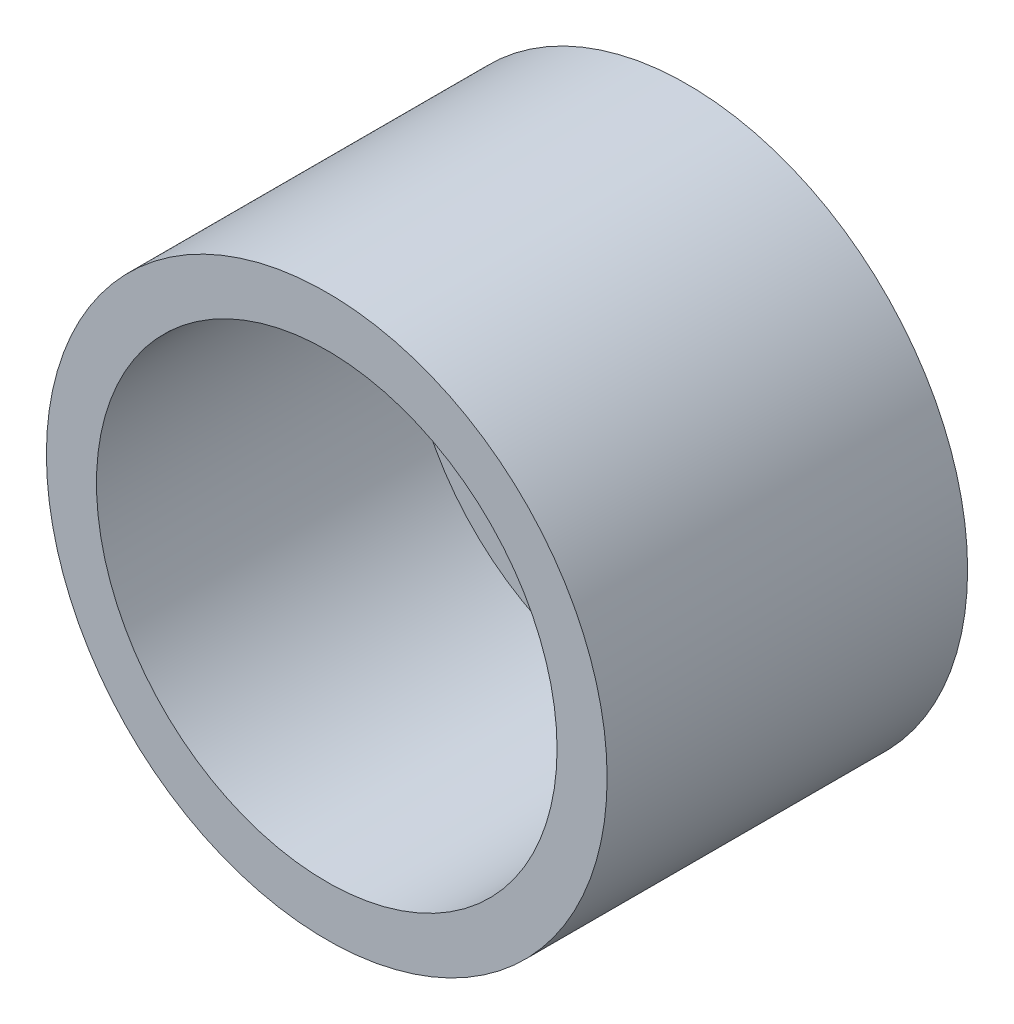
from build123d import *

# Parameters (mm, degrees)
SKETCH1_R           = 14
BOSS_EXTRUDE1_DEPTH = 18
SHELL1_T            = -2.5


with BuildPart() as part:
    # Sketch1 → Boss-Extrude1 (new body)
    with BuildSketch(Plane.XY):
        Circle(SKETCH1_R)
    extrude(amount=BOSS_EXTRUDE1_DEPTH)

    # Shell1
    shell1_openings = [part.faces().sort_by_distance(p)[0] for p in [
        (0, 0, 18),
    ]]
    offset(amount=SHELL1_T, openings=shell1_openings, kind=Kind.INTERSECTION)


solid = part.part
